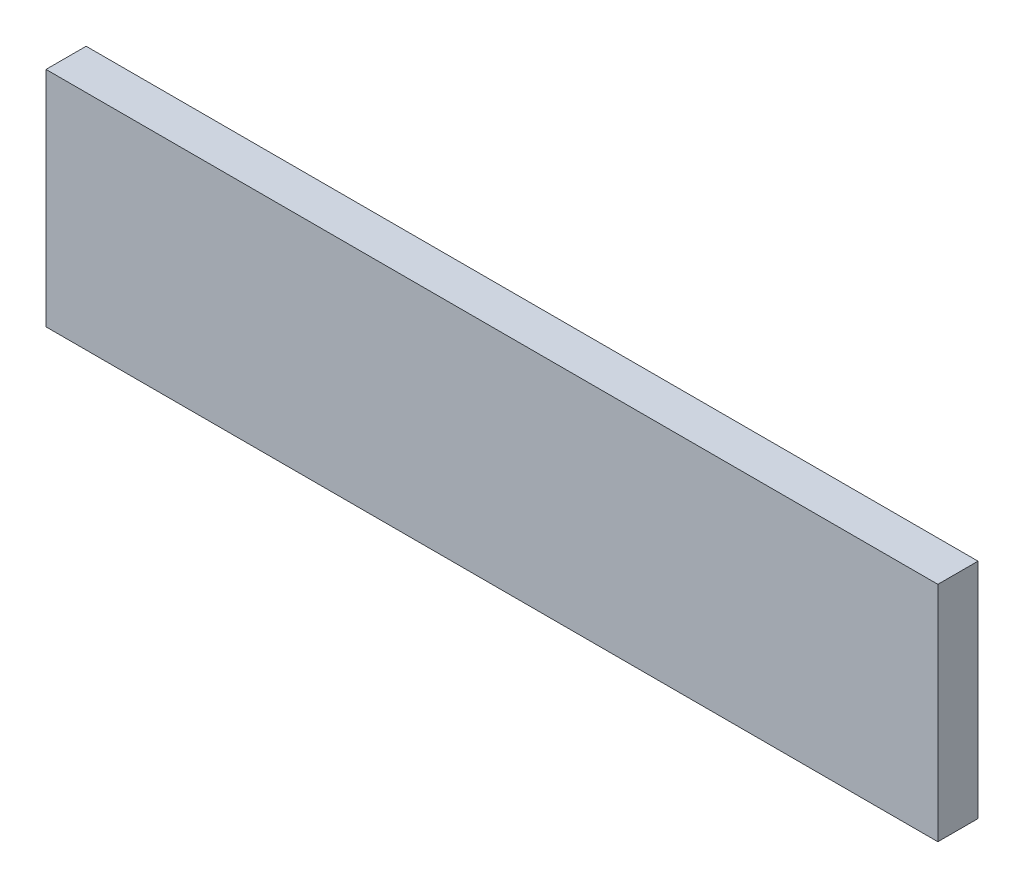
from build123d import *

# Parameters (mm, degrees)
SKETCH1_W      = 40
SKETCH1_H      = 10
EXTRUDE1_DEPTH = 1.8


with BuildPart() as part:
    # Sketch1 → Extrude1 (new body)
    with BuildSketch(Plane.XY):
        with Locations((20, 0)):
            Rectangle(SKETCH1_W, SKETCH1_H)
    extrude(amount=EXTRUDE1_DEPTH)


solid = part.part
